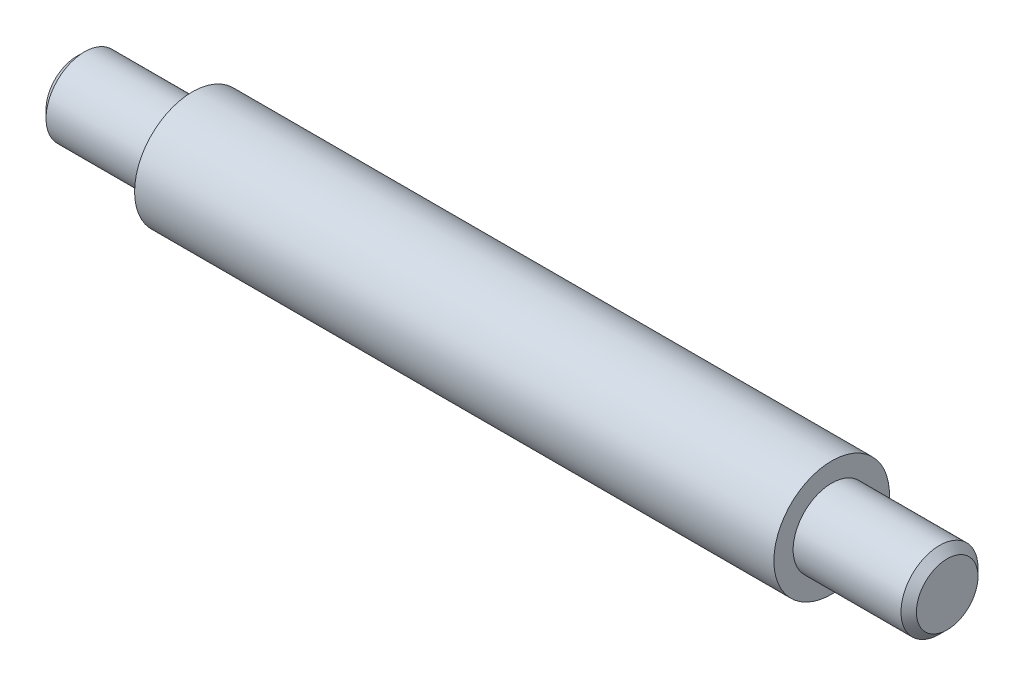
from build123d import *

# Parameters (mm, degrees)
SKIZZE1_R               = 0.5
LINEAR_AUSTRAGEN1_DEPTH = 1.5
SKIZZE2_R               = 0.75
LINEAR_AUSTRAGEN2_DEPTH = 8.3
SKIZZE3_R               = 0.5
LINEAR_AUSTRAGEN3_DEPTH = 1.5
FASE1_SIZE              = 0.1


with BuildPart() as part:
    # Skizze1 → Linear austragen1 (new body)
    with BuildSketch(Plane(origin=(0, 0, 0), x_dir=(0, 0, -1), z_dir=(1, 0, 0))):
        Circle(SKIZZE1_R)
    extrude(amount=LINEAR_AUSTRAGEN1_DEPTH)

    # Skizze2 → Linear austragen2 (add)
    with BuildSketch(Plane(origin=(1.5, 0, 0), x_dir=(0, 0, -1), z_dir=(1, 0, 0))):
        with Locations(Location((0, 0, 0), (0, 0, 180))):
            Circle(SKIZZE2_R)
    extrude(amount=LINEAR_AUSTRAGEN2_DEPTH)

    # Skizze3 → Linear austragen3 (add)
    with BuildSketch(Plane(origin=(9.8, 0, 0), x_dir=(0, 0, -1), z_dir=(1, 0, 0))):
        Circle(SKIZZE3_R)
    extrude(amount=LINEAR_AUSTRAGEN3_DEPTH)

    # Fase1
    fase1_edges = [part.edges().sort_by_distance(p)[0] for p in [
        (11.3, 0, 0.5),
        (0, 0, 0.5),
    ]]
    chamfer(fase1_edges, length=FASE1_SIZE)


solid = part.part
